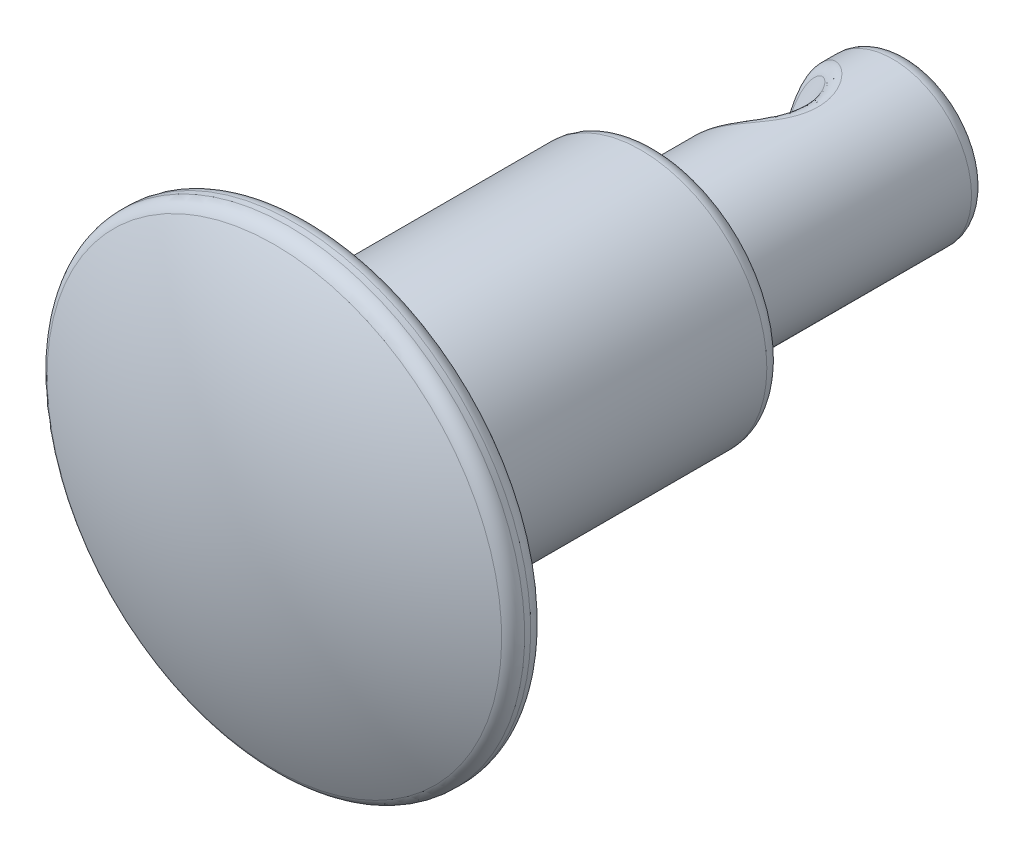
from build123d import *

# Parameters (mm, degrees)
FILLET_1_R          = 0.5
SKETCH_2_R          = 2
CUT_EXTRUDE_1_DEPTH = 64.963379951
FILLET_2_R          = 0.5


with BuildPart() as part:
    # Sketch 1 → Revolve 1 (revolve)
    with BuildSketch(Plane(origin=(0, 0, 0), x_dir=(0, 0, -1), z_dir=(1, 0, 0)), mode=Mode.PRIVATE) as revolve_1_sk:
        with BuildLine():
            Line((-10.901530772, 0), (10.901530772, 0))
            Line((10.901530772, 0), (10.901530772, 2.5))
            Line((10.901530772, 2.5), (2.901530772, 2.5))
            Line((2.901530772, 2.5), (2.901530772, 4))
            Line((2.901530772, 4), (-8.098469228, 4))
            Line((-8.098469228, 4), (-8.098469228, 7.5))
            Line((-8.098469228, 7.5), (-9.098469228, 7.5))
            ThreePointArc((-9.098469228, 7.5), (-10.444433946, 3.856845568), (-10.901530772, 0))
        make_face()
    revolve(revolve_1_sk.sketch.rotate(Axis((0, 0, 10.901530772), (0, 0, -1)), 180), axis=Axis((0, 0, 10.901530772), (0, 0, -1)))

    # Fillet 1
    fillet_1_edges = [part.edges().sort_by_distance(p)[0] for p in [
        (0, 7.5, 9.098469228),
        (0, 7.5, 8.098469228),
        (0, 4, 8.098469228),
        (0, 4, -2.901530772),
        (0, 2.5, -2.901530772),
        (0, 2.5, -10.901530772),
    ]]
    fillet(fillet_1_edges, radius=FILLET_1_R)

    # Sketch 2 → Cut-Extrude 1 (cut, through all)
    with BuildSketch(Plane(origin=(22.515532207, 45.761868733, -7.901530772), x_dir=(0.8657397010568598, -0.50049452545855, 0), z_dir=(-0.50049452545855, -0.8657397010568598, 0))):
        Circle(SKETCH_2_R)
    extrude(amount=CUT_EXTRUDE_1_DEPTH, mode=Mode.SUBTRACT)

    # Fillet 2
    fillet_2_edges = [part.edges().sort_by_distance(p)[0] for p in [
        (-2.254442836, -1.080503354, -7.901530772),
    ]]
    fillet(fillet_2_edges, radius=FILLET_2_R)


solid = part.part
